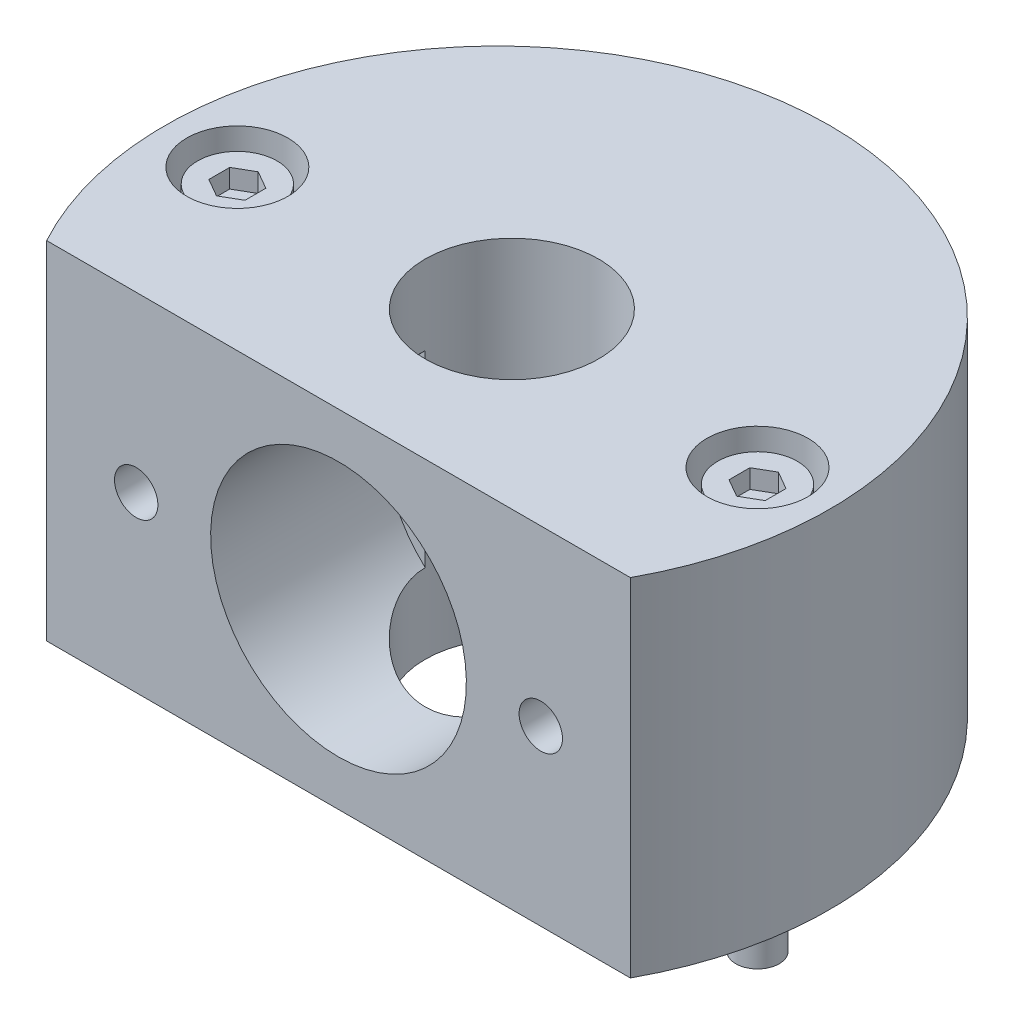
ISO-10303-21;
HEADER;
FILE_DESCRIPTION(('STEP AP214'),'2;1');
FILE_NAME('part.step','',(''),(''),'','','');
FILE_SCHEMA(('AUTOMOTIVE_DESIGN { 1 0 10303 214 1 1 1 1 }'));
ENDSEC;
DATA;
#1=APPLICATION_CONTEXT('core data for automotive mechanical design processes');
#2=APPLICATION_PROTOCOL_DEFINITION('international standard','automotive_design',2000,#1);
#3=PRODUCT_CONTEXT('',#1,'mechanical');
#4=PRODUCT('Part','Part','',(#3));
#5=PRODUCT_RELATED_PRODUCT_CATEGORY('part','',(#4));
#6=PRODUCT_DEFINITION_FORMATION('','',#4);
#7=PRODUCT_DEFINITION_CONTEXT('part definition',#1,'design');
#8=PRODUCT_DEFINITION('design','',#6,#7);
#9=PRODUCT_DEFINITION_SHAPE('','',#8);
#10=(LENGTH_UNIT() NAMED_UNIT(*) SI_UNIT(.MILLI.,.METRE.));
#11=(NAMED_UNIT(*) PLANE_ANGLE_UNIT() SI_UNIT($,.RADIAN.));
#12=(NAMED_UNIT(*) SI_UNIT($,.STERADIAN.) SOLID_ANGLE_UNIT());
#13=UNCERTAINTY_MEASURE_WITH_UNIT(LENGTH_MEASURE(1.E-05),#10,'distance_accuracy_value','');
#14=(GEOMETRIC_REPRESENTATION_CONTEXT(3) GLOBAL_UNCERTAINTY_ASSIGNED_CONTEXT((#13)) GLOBAL_UNIT_ASSIGNED_CONTEXT((#10,
#11,#12)) REPRESENTATION_CONTEXT('',''));
#15=CARTESIAN_POINT('',(0.,0.,0.));
#16=DIRECTION('',(0.,0.,1.));
#17=DIRECTION('',(1.,0.,0.));
#18=AXIS2_PLACEMENT_3D('',#15,#16,#17);
#19=CARTESIAN_POINT('',(0.,0.,0.));
#20=DIRECTION('',(0.,1.,0.));
#21=DIRECTION('',(-1.,0.,0.));
#22=AXIS2_PLACEMENT_3D('',#19,#20,#21);
#23=PLANE('',#22);
#24=CARTESIAN_POINT('',(-18.,-1.25693328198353E-13,0.));
#25=DIRECTION('',(0.,1.,0.));
#26=DIRECTION('',(-1.,0.,0.));
#27=AXIS2_PLACEMENT_3D('',#24,#25,#26);
#28=CIRCLE('',#27,1.75);
#29=CARTESIAN_POINT('',(-19.75,-1.37913512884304E-13,0.));
#30=VERTEX_POINT('',#29);
#31=EDGE_CURVE('E416',#30,#30,#28,.T.);
#32=ORIENTED_EDGE('',*,*,#31,.T.);
#33=EDGE_LOOP('',(#32));
#34=FACE_BOUND('',#33,.T.);
#35=CARTESIAN_POINT('',(0.,0.,-1.));
#36=DIRECTION('',(0.,1.,0.));
#37=DIRECTION('',(-1.,0.,0.));
#38=AXIS2_PLACEMENT_3D('',#35,#36,#37);
#39=CIRCLE('',#38,6.);
#40=CARTESIAN_POINT('',(-6.,0.,-1.));
#41=VERTEX_POINT('',#40);
#42=EDGE_CURVE('E420',#41,#41,#39,.T.);
#43=ORIENTED_EDGE('',*,*,#42,.T.);
#44=EDGE_LOOP('',(#43));
#45=FACE_BOUND('',#44,.T.);
#46=CARTESIAN_POINT('',(18.,1.25693328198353E-13,0.));
#47=DIRECTION('',(0.,1.,0.));
#48=DIRECTION('',(-1.,0.,0.));
#49=AXIS2_PLACEMENT_3D('',#46,#47,#48);
#50=CIRCLE('',#49,1.75);
#51=CARTESIAN_POINT('',(16.25,1.13473143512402E-13,0.));
#52=VERTEX_POINT('',#51);
#53=EDGE_CURVE('E423',#52,#52,#50,.T.);
#54=ORIENTED_EDGE('',*,*,#53,.T.);
#55=EDGE_LOOP('',(#54));
#56=FACE_BOUND('',#55,.T.);
#57=CARTESIAN_POINT('',(0.,0.,0.));
#58=DIRECTION('',(0.,1.,0.));
#59=DIRECTION('',(-1.,0.,0.));
#60=AXIS2_PLACEMENT_3D('',#57,#58,#59);
#61=CIRCLE('',#60,23.);
#62=CARTESIAN_POINT('',(20.1990098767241,1.79455226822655E-13,11.));
#63=VERTEX_POINT('',#62);
#64=CARTESIAN_POINT('',(-20.1990098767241,-1.02642637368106E-13,11.));
#65=VERTEX_POINT('',#64);
#66=EDGE_CURVE('E28',#63,#65,#61,.T.);
#67=ORIENTED_EDGE('',*,*,#66,.F.);
#68=DIRECTION('',(1.,0.,0.));
#69=VECTOR('',#68,1.);
#70=CARTESIAN_POINT('',(20.1990098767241,1.79455226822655E-13,11.));
#71=LINE('',#70,#69);
#72=EDGE_CURVE('E445',#65,#63,#71,.T.);
#73=ORIENTED_EDGE('',*,*,#72,.F.);
#74=EDGE_LOOP('',(#67,#73));
#75=FACE_BOUND('',#74,.T.);
#76=ADVANCED_FACE('F14',(#34,#45,#56,#75),#23,.F.);
#77=CARTESIAN_POINT('',(-15.3,12.,5.));
#78=DIRECTION('',(0.,0.,-1.));
#79=DIRECTION('',(0.,-1.,0.));
#80=AXIS2_PLACEMENT_3D('',#77,#78,#79);
#81=PLANE('',#80);
#82=CARTESIAN_POINT('',(-14.,12.,5.));
#83=DIRECTION('',(0.,0.,1.));
#84=DIRECTION('',(0.,1.,0.));
#85=AXIS2_PLACEMENT_3D('',#82,#83,#84);
#86=CIRCLE('',#85,1.5);
#87=CARTESIAN_POINT('',(-14.,13.5,4.99999999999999));
#88=VERTEX_POINT('',#87);
#89=EDGE_CURVE('E246',#88,#88,#86,.T.);
#90=ORIENTED_EDGE('',*,*,#89,.T.);
#91=EDGE_LOOP('',(#90));
#92=FACE_BOUND('',#91,.T.);
#93=ADVANCED_FACE('F292',(#92),#81,.F.);
#94=CARTESIAN_POINT('',(-14.,12.,11.));
#95=DIRECTION('',(0.,0.,1.));
#96=DIRECTION('',(0.,1.,0.));
#97=AXIS2_PLACEMENT_3D('',#94,#95,#96);
#98=CYLINDRICAL_SURFACE('',#97,1.5);
#99=ORIENTED_EDGE('',*,*,#89,.F.);
#100=EDGE_LOOP('',(#99));
#101=FACE_BOUND('',#100,.T.);
#102=CARTESIAN_POINT('',(-14.,12.,11.));
#103=DIRECTION('',(0.,0.,-1.));
#104=DIRECTION('',(0.,-1.,0.));
#105=AXIS2_PLACEMENT_3D('',#102,#103,#104);
#106=CIRCLE('',#105,1.5);
#107=CARTESIAN_POINT('',(-14.,10.5,11.));
#108=VERTEX_POINT('',#107);
#109=EDGE_CURVE('E235',#108,#108,#106,.F.);
#110=ORIENTED_EDGE('',*,*,#109,.T.);
#111=EDGE_LOOP('',(#110));
#112=FACE_BOUND('',#111,.T.);
#113=ADVANCED_FACE('F295',(#101,#112),#98,.F.);
#114=CARTESIAN_POINT('',(18.,24.,0.));
#115=DIRECTION('',(0.,1.,0.));
#116=DIRECTION('',(-1.,0.,0.));
#117=AXIS2_PLACEMENT_3D('',#114,#115,#116);
#118=CYLINDRICAL_SURFACE('',#117,1.75);
#119=CARTESIAN_POINT('',(18.,20.,0.));
#120=DIRECTION('',(0.,1.,0.));
#121=DIRECTION('',(-1.,0.,0.));
#122=AXIS2_PLACEMENT_3D('',#119,#120,#121);
#123=CIRCLE('',#122,1.75);
#124=CARTESIAN_POINT('',(16.25,20.,0.));
#125=VERTEX_POINT('',#124);
#126=EDGE_CURVE('E135',#125,#125,#123,.F.);
#127=ORIENTED_EDGE('',*,*,#126,.F.);
#128=EDGE_LOOP('',(#127));
#129=FACE_BOUND('',#128,.T.);
#130=ORIENTED_EDGE('',*,*,#53,.F.);
#131=EDGE_LOOP('',(#130));
#132=FACE_BOUND('',#131,.T.);
#133=ADVANCED_FACE('F311',(#129,#132),#118,.F.);
#134=CARTESIAN_POINT('',(14.4999999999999,20.,0.));
#135=DIRECTION('',(0.,-1.,0.));
#136=DIRECTION('',(1.,0.,0.));
#137=AXIS2_PLACEMENT_3D('',#134,#135,#136);
#138=PLANE('',#137);
#139=CARTESIAN_POINT('',(18.,20.,0.));
#140=DIRECTION('',(0.,-1.,0.));
#141=DIRECTION('',(1.,0.,0.));
#142=AXIS2_PLACEMENT_3D('',#139,#140,#141);
#143=CIRCLE('',#142,2.75);
#144=CARTESIAN_POINT('',(20.75,20.,0.));
#145=VERTEX_POINT('',#144);
#146=EDGE_CURVE('E9',#145,#145,#143,.F.);
#147=ORIENTED_EDGE('',*,*,#146,.F.);
#148=EDGE_LOOP('',(#147));
#149=FACE_BOUND('',#148,.T.);
#150=CARTESIAN_POINT('',(18.,20.,0.));
#151=DIRECTION('',(0.,1.,0.));
#152=DIRECTION('',(-1.,0.,0.));
#153=AXIS2_PLACEMENT_3D('',#150,#151,#152);
#154=CIRCLE('',#153,3.5);
#155=CARTESIAN_POINT('',(14.5,20.,0.));
#156=VERTEX_POINT('',#155);
#157=EDGE_CURVE('E236',#156,#156,#154,.T.);
#158=ORIENTED_EDGE('',*,*,#157,.T.);
#159=EDGE_LOOP('',(#158));
#160=FACE_BOUND('',#159,.T.);
#161=ADVANCED_FACE('F308',(#149,#160),#138,.F.);
#162=CARTESIAN_POINT('',(18.,24.,0.));
#163=DIRECTION('',(0.,1.,0.));
#164=DIRECTION('',(-1.,0.,0.));
#165=AXIS2_PLACEMENT_3D('',#162,#163,#164);
#166=CYLINDRICAL_SURFACE('',#165,3.5);
#167=ORIENTED_EDGE('',*,*,#157,.F.);
#168=EDGE_LOOP('',(#167));
#169=FACE_BOUND('',#168,.T.);
#170=CARTESIAN_POINT('',(18.,24.,0.));
#171=DIRECTION('',(0.,1.,0.));
#172=DIRECTION('',(-1.,0.,0.));
#173=AXIS2_PLACEMENT_3D('',#170,#171,#172);
#174=CIRCLE('',#173,3.5);
#175=CARTESIAN_POINT('',(14.5,24.,0.));
#176=VERTEX_POINT('',#175);
#177=EDGE_CURVE('E425',#176,#176,#174,.T.);
#178=ORIENTED_EDGE('',*,*,#177,.T.);
#179=EDGE_LOOP('',(#178));
#180=FACE_BOUND('',#179,.T.);
#181=ADVANCED_FACE('F301',(#169,#180),#166,.F.);
#182=CARTESIAN_POINT('',(12.7,12.,5.));
#183=DIRECTION('',(0.,0.,-1.));
#184=DIRECTION('',(0.,-1.,0.));
#185=AXIS2_PLACEMENT_3D('',#182,#183,#184);
#186=PLANE('',#185);
#187=CARTESIAN_POINT('',(14.,12.0000000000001,5.));
#188=DIRECTION('',(0.,0.,1.));
#189=DIRECTION('',(0.,1.,0.));
#190=AXIS2_PLACEMENT_3D('',#187,#188,#189);
#191=CIRCLE('',#190,1.5);
#192=CARTESIAN_POINT('',(14.,13.5000000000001,4.99999999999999));
#193=VERTEX_POINT('',#192);
#194=EDGE_CURVE('E243',#193,#193,#191,.T.);
#195=ORIENTED_EDGE('',*,*,#194,.T.);
#196=EDGE_LOOP('',(#195));
#197=FACE_BOUND('',#196,.T.);
#198=ADVANCED_FACE('F297',(#197),#186,.F.);
#199=CARTESIAN_POINT('',(14.,12.0000000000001,11.));
#200=DIRECTION('',(0.,0.,1.));
#201=DIRECTION('',(0.,1.,0.));
#202=AXIS2_PLACEMENT_3D('',#199,#200,#201);
#203=CYLINDRICAL_SURFACE('',#202,1.5);
#204=ORIENTED_EDGE('',*,*,#194,.F.);
#205=EDGE_LOOP('',(#204));
#206=FACE_BOUND('',#205,.T.);
#207=CARTESIAN_POINT('',(14.,12.0000000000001,11.));
#208=DIRECTION('',(0.,0.,-1.));
#209=DIRECTION('',(0.,-1.,0.));
#210=AXIS2_PLACEMENT_3D('',#207,#208,#209);
#211=CIRCLE('',#210,1.5);
#212=CARTESIAN_POINT('',(14.,10.5000000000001,11.));
#213=VERTEX_POINT('',#212);
#214=EDGE_CURVE('E240',#213,#213,#211,.F.);
#215=ORIENTED_EDGE('',*,*,#214,.T.);
#216=EDGE_LOOP('',(#215));
#217=FACE_BOUND('',#216,.T.);
#218=ADVANCED_FACE('F300',(#206,#217),#203,.F.);
#219=CARTESIAN_POINT('',(-1.6759110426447E-13,24.,0.));
#220=DIRECTION('',(0.,1.,0.));
#221=DIRECTION('',(-1.,0.,0.));
#222=AXIS2_PLACEMENT_3D('',#219,#220,#221);
#223=PLANE('',#222);
#224=ORIENTED_EDGE('',*,*,#177,.F.);
#225=EDGE_LOOP('',(#224));
#226=FACE_BOUND('',#225,.T.);
#227=CARTESIAN_POINT('',(-1.6759110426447E-13,24.,0.));
#228=DIRECTION('',(0.,1.,0.));
#229=DIRECTION('',(-1.,0.,0.));
#230=AXIS2_PLACEMENT_3D('',#227,#228,#229);
#231=CIRCLE('',#230,23.);
#232=CARTESIAN_POINT('',(-20.1990098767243,24.,11.));
#233=VERTEX_POINT('',#232);
#234=CARTESIAN_POINT('',(20.199009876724,24.,11.));
#235=VERTEX_POINT('',#234);
#236=EDGE_CURVE('E438',#233,#235,#231,.F.);
#237=ORIENTED_EDGE('',*,*,#236,.F.);
#238=DIRECTION('',(-1.,0.,0.));
#239=VECTOR('',#238,1.);
#240=CARTESIAN_POINT('',(-1.6759110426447E-13,24.,11.));
#241=LINE('',#240,#239);
#242=EDGE_CURVE('E435',#235,#233,#241,.T.);
#243=ORIENTED_EDGE('',*,*,#242,.F.);
#244=EDGE_LOOP('',(#237,#243));
#245=FACE_BOUND('',#244,.T.);
#246=CARTESIAN_POINT('',(-1.6759110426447E-13,24.,-1.00000000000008));
#247=DIRECTION('',(0.,1.,0.));
#248=DIRECTION('',(-1.,0.,0.));
#249=AXIS2_PLACEMENT_3D('',#246,#247,#248);
#250=CIRCLE('',#249,6.);
#251=CARTESIAN_POINT('',(-6.00000000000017,24.,-1.00000000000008));
#252=VERTEX_POINT('',#251);
#253=EDGE_CURVE('E491',#252,#252,#250,.T.);
#254=ORIENTED_EDGE('',*,*,#253,.F.);
#255=EDGE_LOOP('',(#254));
#256=FACE_BOUND('',#255,.T.);
#257=CARTESIAN_POINT('',(-18.,24.,0.));
#258=DIRECTION('',(0.,1.,0.));
#259=DIRECTION('',(-1.,0.,0.));
#260=AXIS2_PLACEMENT_3D('',#257,#258,#259);
#261=CIRCLE('',#260,3.5);
#262=CARTESIAN_POINT('',(-21.5,24.,0.));
#263=VERTEX_POINT('',#262);
#264=EDGE_CURVE('E441',#263,#263,#261,.T.);
#265=ORIENTED_EDGE('',*,*,#264,.F.);
#266=EDGE_LOOP('',(#265));
#267=FACE_BOUND('',#266,.T.);
#268=ADVANCED_FACE('F458',(#226,#245,#256,#267),#223,.T.);
#269=CARTESIAN_POINT('',(-1.6759110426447E-13,24.,0.));
#270=DIRECTION('',(0.,-1.,0.));
#271=DIRECTION('',(1.,0.,0.));
#272=AXIS2_PLACEMENT_3D('',#269,#270,#271);
#273=CYLINDRICAL_SURFACE('',#272,23.);
#274=DIRECTION('',(0.,-1.,0.));
#275=VECTOR('',#274,1.);
#276=CARTESIAN_POINT('',(20.199009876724,24.,11.));
#277=LINE('',#276,#275);
#278=EDGE_CURVE('E253',#235,#63,#277,.T.);
#279=ORIENTED_EDGE('',*,*,#278,.T.);
#280=ORIENTED_EDGE('',*,*,#66,.T.);
#281=DIRECTION('',(0.,-1.,0.));
#282=VECTOR('',#281,1.);
#283=CARTESIAN_POINT('',(-20.1990098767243,24.,11.));
#284=LINE('',#283,#282);
#285=EDGE_CURVE('E255',#233,#65,#284,.T.);
#286=ORIENTED_EDGE('',*,*,#285,.F.);
#287=ORIENTED_EDGE('',*,*,#236,.T.);
#288=EDGE_LOOP('',(#279,#280,#286,#287));
#289=FACE_BOUND('',#288,.T.);
#290=ADVANCED_FACE('F460',(#289),#273,.T.);
#291=CARTESIAN_POINT('',(20.199009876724,24.,11.));
#292=DIRECTION('',(0.,0.,-1.));
#293=DIRECTION('',(0.,-1.,0.));
#294=AXIS2_PLACEMENT_3D('',#291,#292,#293);
#295=PLANE('',#294);
#296=ORIENTED_EDGE('',*,*,#109,.F.);
#297=EDGE_LOOP('',(#296));
#298=FACE_BOUND('',#297,.T.);
#299=ORIENTED_EDGE('',*,*,#214,.F.);
#300=EDGE_LOOP('',(#299));
#301=FACE_BOUND('',#300,.T.);
#302=CARTESIAN_POINT('',(0.,12.,11.));
#303=DIRECTION('',(0.,0.,-1.));
#304=DIRECTION('',(0.,-1.,0.));
#305=AXIS2_PLACEMENT_3D('',#302,#303,#304);
#306=CIRCLE('',#305,8.85);
#307=CARTESIAN_POINT('',(0.,3.15,11.));
#308=VERTEX_POINT('',#307);
#309=EDGE_CURVE('E439',#308,#308,#306,.F.);
#310=ORIENTED_EDGE('',*,*,#309,.F.);
#311=EDGE_LOOP('',(#310));
#312=FACE_BOUND('',#311,.T.);
#313=ORIENTED_EDGE('',*,*,#285,.T.);
#314=ORIENTED_EDGE('',*,*,#72,.T.);
#315=ORIENTED_EDGE('',*,*,#278,.F.);
#316=ORIENTED_EDGE('',*,*,#242,.T.);
#317=EDGE_LOOP('',(#313,#314,#315,#316));
#318=FACE_BOUND('',#317,.T.);
#319=ADVANCED_FACE('F290',(#298,#301,#312,#318),#295,.F.);
#320=CARTESIAN_POINT('',(0.,12.,-1.00000000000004));
#321=DIRECTION('',(0.,0.,1.));
#322=DIRECTION('',(0.,1.,0.));
#323=AXIS2_PLACEMENT_3D('',#320,#321,#322);
#324=PLANE('',#323);
#325=CARTESIAN_POINT('',(0.,12.,-1.00000000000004));
#326=DIRECTION('',(0.,0.,1.));
#327=DIRECTION('',(0.,1.,0.));
#328=AXIS2_PLACEMENT_3D('',#325,#326,#327);
#329=CIRCLE('',#328,8.85);
#330=CARTESIAN_POINT('',(6.,5.49442546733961,-1.00000000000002));
#331=VERTEX_POINT('',#330);
#332=CARTESIAN_POINT('',(5.99999999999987,18.5055745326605,-1.00000000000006));
#333=VERTEX_POINT('',#332);
#334=EDGE_CURVE('E249',#331,#333,#329,.T.);
#335=ORIENTED_EDGE('',*,*,#334,.T.);
#336=DIRECTION('',(0.,-1.,0.));
#337=VECTOR('',#336,1.);
#338=CARTESIAN_POINT('',(5.99999999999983,24.,-1.00000000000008));
#339=LINE('',#338,#337);
#340=EDGE_CURVE('E258',#331,#333,#339,.F.);
#341=ORIENTED_EDGE('',*,*,#340,.F.);
#342=EDGE_LOOP('',(#335,#341));
#343=FACE_BOUND('',#342,.T.);
#344=ADVANCED_FACE('F285',(#343),#324,.T.);
#345=CARTESIAN_POINT('',(-6.00000000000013,18.5055745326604,-1.00000000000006));
#346=VERTEX_POINT('',#345);
#347=CARTESIAN_POINT('',(-6.,5.49442546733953,-1.00000000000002));
#348=VERTEX_POINT('',#347);
#349=EDGE_CURVE('E250',#346,#348,#329,.T.);
#350=ORIENTED_EDGE('',*,*,#349,.T.);
#351=DIRECTION('',(0.,-1.,0.));
#352=VECTOR('',#351,1.);
#353=CARTESIAN_POINT('',(-6.00000000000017,24.,-1.00000000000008));
#354=LINE('',#353,#352);
#355=EDGE_CURVE('E494',#346,#348,#354,.T.);
#356=ORIENTED_EDGE('',*,*,#355,.F.);
#357=EDGE_LOOP('',(#350,#356));
#358=FACE_BOUND('',#357,.T.);
#359=ADVANCED_FACE('F289',(#358),#324,.T.);
#360=CARTESIAN_POINT('',(-1.6759110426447E-13,24.,-1.00000000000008));
#361=DIRECTION('',(0.,-1.,0.));
#362=DIRECTION('',(1.,0.,0.));
#363=AXIS2_PLACEMENT_3D('',#360,#361,#362);
#364=CYLINDRICAL_SURFACE('',#363,6.);
#365=ORIENTED_EDGE('',*,*,#42,.F.);
#366=EDGE_LOOP('',(#365));
#367=FACE_BOUND('',#366,.T.);
#368=ORIENTED_EDGE('',*,*,#253,.T.);
#369=EDGE_LOOP('',(#368));
#370=FACE_BOUND('',#369,.T.);
#371=CARTESIAN_POINT('',(5.99999999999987,18.5055745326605,-1.00000000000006));
#372=CARTESIAN_POINT('',(6.00004016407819,18.5054890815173,-0.85328037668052));
#373=CARTESIAN_POINT('',(5.99462041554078,18.5105355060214,-0.70661127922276));
#374=CARTESIAN_POINT('',(5.973180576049,18.5302366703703,-0.414901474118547));
#375=CARTESIAN_POINT('',(5.95717551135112,18.5448777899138,-0.269858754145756));
#376=CARTESIAN_POINT('',(5.91509921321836,18.5829207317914,0.0160243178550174));
#377=CARTESIAN_POINT('',(5.88913262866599,18.6062314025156,0.15689248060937));
#378=CARTESIAN_POINT('',(5.82760701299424,18.6605697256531,0.435020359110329));
#379=CARTESIAN_POINT('',(5.79204500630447,18.6915997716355,0.572278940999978));
#380=CARTESIAN_POINT('',(5.71207905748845,18.7599848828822,0.84168211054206));
#381=CARTESIAN_POINT('',(5.66772518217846,18.7973039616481,0.973850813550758));
#382=CARTESIAN_POINT('',(5.57056918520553,18.8771517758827,1.23337389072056));
#383=CARTESIAN_POINT('',(5.51776753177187,18.9196802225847,1.36072853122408));
#384=CARTESIAN_POINT('',(5.34706244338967,19.0535330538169,1.73578770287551));
#385=CARTESIAN_POINT('',(5.21704283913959,19.150960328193,1.97587819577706));
#386=CARTESIAN_POINT('',(4.90428382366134,19.3696984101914,2.47087746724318));
#387=CARTESIAN_POINT('',(4.71642999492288,19.4923312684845,2.72196713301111));
#388=CARTESIAN_POINT('',(4.4071236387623,19.6755600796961,3.07451920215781));
#389=CARTESIAN_POINT('',(4.29936808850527,19.7365491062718,3.18807778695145));
#390=CARTESIAN_POINT('',(4.07484546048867,19.8571210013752,3.40683625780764));
#391=CARTESIAN_POINT('',(3.9580763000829,19.9167035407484,3.51203420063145));
#392=CARTESIAN_POINT('',(3.69734442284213,20.0421484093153,3.72891337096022));
#393=CARTESIAN_POINT('',(3.55195202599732,20.1075803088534,3.83913155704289));
#394=CARTESIAN_POINT('',(3.25022557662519,20.2331779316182,4.04673612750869));
#395=CARTESIAN_POINT('',(3.09389642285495,20.2933459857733,4.1441282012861));
#396=CARTESIAN_POINT('',(2.77116689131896,20.4066849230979,4.32492296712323));
#397=CARTESIAN_POINT('',(2.60477780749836,20.4598634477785,4.40834096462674));
#398=CARTESIAN_POINT('',(2.26286729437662,20.5576578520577,4.56006963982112));
#399=CARTESIAN_POINT('',(2.08734954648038,20.602277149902,4.6283863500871));
#400=CARTESIAN_POINT('',(1.77448478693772,20.671356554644,4.73332832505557));
#401=CARTESIAN_POINT('',(1.63883961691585,20.6980547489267,4.77359123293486));
#402=CARTESIAN_POINT('',(1.36405433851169,20.7453574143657,4.84461120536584));
#403=CARTESIAN_POINT('',(1.22491498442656,20.7659631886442,4.87537030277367));
#404=CARTESIAN_POINT('',(0.944091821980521,20.8006360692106,4.92697732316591));
#405=CARTESIAN_POINT('',(0.802409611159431,20.8147071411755,4.94783125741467));
#406=CARTESIAN_POINT('',(0.517398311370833,20.8360182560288,4.97936904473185));
#407=CARTESIAN_POINT('',(0.374069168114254,20.8432580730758,4.99005256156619));
#408=CARTESIAN_POINT('',(0.0865870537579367,20.8507464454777,5.00110234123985));
#409=CARTESIAN_POINT('',(-0.0575669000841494,20.8509831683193,5.00145114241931));
#410=CARTESIAN_POINT('',(-0.345364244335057,20.8444299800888,4.99178222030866));
#411=CARTESIAN_POINT('',(-0.489007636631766,20.837640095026,4.98176453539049));
#412=CARTESIAN_POINT('',(-0.774723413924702,20.8171888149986,4.95150759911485));
#413=CARTESIAN_POINT('',(-0.916795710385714,20.8035270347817,4.9312677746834));
#414=CARTESIAN_POINT('',(-1.19841556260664,20.7696309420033,4.88083962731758));
#415=CARTESIAN_POINT('',(-1.337962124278,20.7493940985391,4.85064747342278));
#416=CARTESIAN_POINT('',(-1.61101812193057,20.7032137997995,4.78135676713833));
#417=CARTESIAN_POINT('',(-1.74459159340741,20.6773836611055,4.74243458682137));
#418=CARTESIAN_POINT('',(-2.00769775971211,20.6203134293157,4.6558251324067));
#419=CARTESIAN_POINT('',(-2.13722901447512,20.5890714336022,4.60813477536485));
#420=CARTESIAN_POINT('',(-2.51872934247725,20.4880821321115,4.45264179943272));
#421=CARTESIAN_POINT('',(-2.76381341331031,20.4110349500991,4.33236350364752));
#422=CARTESIAN_POINT('',(-3.25804867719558,20.2331230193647,4.04733493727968));
#423=CARTESIAN_POINT('',(-3.50454447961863,20.1305525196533,3.87910006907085));
#424=CARTESIAN_POINT('',(-3.96761628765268,19.914908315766,3.51061843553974));
#425=CARTESIAN_POINT('',(-4.18415647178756,19.8018223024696,3.31033395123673));
#426=CARTESIAN_POINT('',(-4.5016629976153,19.6207465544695,2.97045091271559));
#427=CARTESIAN_POINT('',(-4.61327842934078,19.5535336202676,2.84019527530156));
#428=CARTESIAN_POINT('',(-4.82519597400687,19.4199496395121,2.57028385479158));
#429=CARTESIAN_POINT('',(-4.92549572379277,19.3535787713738,2.4306261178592));
#430=CARTESIAN_POINT('',(-5.11421312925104,19.2236036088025,2.14236758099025));
#431=CARTESIAN_POINT('',(-5.20263648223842,19.1599979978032,1.99377111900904));
#432=CARTESIAN_POINT('',(-5.36703321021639,19.037610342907,1.68796124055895));
#433=CARTESIAN_POINT('',(-5.44300470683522,18.9788290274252,1.53074652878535));
#434=CARTESIAN_POINT('',(-5.61708379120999,18.8402335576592,1.12568346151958));
#435=CARTESIAN_POINT('',(-5.7067626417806,18.7649521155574,0.872450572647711));
#436=CARTESIAN_POINT('',(-5.81577371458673,18.6709500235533,0.481573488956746));
#437=CARTESIAN_POINT('',(-5.8478372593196,18.6427908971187,0.349601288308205));
#438=CARTESIAN_POINT('',(-5.90311390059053,18.593717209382,0.0825062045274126));
#439=CARTESIAN_POINT('',(-5.9263309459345,18.5727994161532,-0.0526152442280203));
#440=CARTESIAN_POINT('',(-5.96314368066,18.5394235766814,-0.322453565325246));
#441=CARTESIAN_POINT('',(-5.97691971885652,18.5268071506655,-0.457126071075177));
#442=CARTESIAN_POINT('',(-5.99537070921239,18.5098435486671,-0.727851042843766));
#443=CARTESIAN_POINT('',(-6.00002911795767,18.5055114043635,-0.863905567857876));
#444=CARTESIAN_POINT('',(-6.00000000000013,18.5055745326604,-1.00000000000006));
#445=B_SPLINE_CURVE_WITH_KNOTS('',3,(#371,#372,#373,#374,#375,#376,#377,#378,#379,#380,#381,
#382,#383,#384,#385,#386,#387,#388,#389,#390,#391,#392,#393,#394,#395,#396,#397,#398,#399,#400,
#401,#402,#403,#404,#405,#406,#407,#408,#409,#410,#411,#412,#413,#414,#415,#416,#417,#418,#419,
#420,#421,#422,#423,#424,#425,#426,#427,#428,#429,#430,#431,#432,#433,#434,#435,#436,#437,#438,
#439,#440,#441,#442,#443,#444),.UNSPECIFIED.,.F.,.F.,(4,2,2,2,2,2,2,2,2,2,2,2,2,2,2,2,2,2,2,2,2,
2,2,2,2,2,2,2,2,2,2,2,2,2,2,2,4),(0.,0.439891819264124,0.879160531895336,1.31393565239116,
1.74884575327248,2.18134687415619,2.61382403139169,3.48073117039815,4.48695302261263,
4.99060979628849,5.4943832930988,6.07508512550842,6.65552849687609,7.23533190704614,
7.81490328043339,8.2464321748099,8.67786870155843,9.10904306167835,9.54023167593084,
9.97214879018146,10.4040643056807,10.8360040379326,11.2681102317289,11.692167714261,
12.1163745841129,12.9641402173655,13.9074634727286,14.8519051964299,15.4041032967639,
15.9564165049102,16.5084638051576,17.0605943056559,17.8938915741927,18.3095849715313,
18.7250925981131,19.132423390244,19.5404925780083),.UNSPECIFIED.);
#446=EDGE_CURVE('E270',#333,#346,#445,.T.);
#447=ORIENTED_EDGE('',*,*,#446,.T.);
#448=ORIENTED_EDGE('',*,*,#355,.T.);
#449=CARTESIAN_POINT('',(-6.,5.49442546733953,-1.00000000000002));
#450=CARTESIAN_POINT('',(-6.00004016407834,5.49451091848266,-0.853280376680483));
#451=CARTESIAN_POINT('',(-5.99462041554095,5.4894644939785,-0.706611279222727));
#452=CARTESIAN_POINT('',(-5.97318057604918,5.46976332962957,-0.414901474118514));
#453=CARTESIAN_POINT('',(-5.95717551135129,5.45512221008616,-0.269858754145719));
#454=CARTESIAN_POINT('',(-5.91509921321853,5.41707926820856,0.0160243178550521));
#455=CARTESIAN_POINT('',(-5.88913262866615,5.39376859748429,0.1568924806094));
#456=CARTESIAN_POINT('',(-5.82760701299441,5.33943027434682,0.435020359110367));
#457=CARTESIAN_POINT('',(-5.79204500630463,5.3084002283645,0.572278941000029));
#458=CARTESIAN_POINT('',(-5.71207905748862,5.24001511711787,0.841682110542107));
#459=CARTESIAN_POINT('',(-5.66772518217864,5.2026960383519,0.973850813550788));
#460=CARTESIAN_POINT('',(-5.57056918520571,5.12284822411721,1.23337389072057));
#461=CARTESIAN_POINT('',(-5.51776753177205,5.08031977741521,1.3607285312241));
#462=CARTESIAN_POINT('',(-5.34706244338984,4.94646694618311,1.73578770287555));
#463=CARTESIAN_POINT('',(-5.21704283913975,4.84903967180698,1.97587819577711));
#464=CARTESIAN_POINT('',(-4.9042838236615,4.63030158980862,2.47087746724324));
#465=CARTESIAN_POINT('',(-4.71642999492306,4.50766873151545,2.72196713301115));
#466=CARTESIAN_POINT('',(-4.4071236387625,4.32443992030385,3.07451920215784));
#467=CARTESIAN_POINT('',(-4.29936808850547,4.26345089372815,3.18807778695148));
#468=CARTESIAN_POINT('',(-4.07484546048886,4.14287899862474,3.40683625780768));
#469=CARTESIAN_POINT('',(-3.95807630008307,4.08329645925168,3.5120342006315));
#470=CARTESIAN_POINT('',(-3.6973444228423,3.95785159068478,3.72891337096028));
#471=CARTESIAN_POINT('',(-3.55195202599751,3.89241969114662,3.83913155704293));
#472=CARTESIAN_POINT('',(-3.25022557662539,3.7668220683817,4.04673612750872));
#473=CARTESIAN_POINT('',(-3.09389642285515,3.70665401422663,4.14412820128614));
#474=CARTESIAN_POINT('',(-2.77116689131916,3.59331507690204,4.32492296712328));
#475=CARTESIAN_POINT('',(-2.60477780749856,3.54013655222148,4.40834096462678));
#476=CARTESIAN_POINT('',(-2.26286729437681,3.44234214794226,4.56006963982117));
#477=CARTESIAN_POINT('',(-2.08734954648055,3.39772285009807,4.62838635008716));
#478=CARTESIAN_POINT('',(-1.77448478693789,3.32864344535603,4.73332832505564));
#479=CARTESIAN_POINT('',(-1.63883961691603,3.30194525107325,4.77359123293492));
#480=CARTESIAN_POINT('',(-1.36405433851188,3.25464258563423,4.8446112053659));
#481=CARTESIAN_POINT('',(-1.22491498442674,3.23403681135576,4.87537030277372));
#482=CARTESIAN_POINT('',(-0.944091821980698,3.19936393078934,4.92697732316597));
#483=CARTESIAN_POINT('',(-0.802409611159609,3.18529285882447,4.94783125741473));
#484=CARTESIAN_POINT('',(-0.517398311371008,3.16398174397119,4.97936904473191));
#485=CARTESIAN_POINT('',(-0.374069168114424,3.15674192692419,4.99005256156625));
#486=CARTESIAN_POINT('',(-0.0865870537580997,3.14925355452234,5.00110234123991));
#487=CARTESIAN_POINT('',(0.057566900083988,3.14901683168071,5.00145114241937));
#488=CARTESIAN_POINT('',(0.345364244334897,3.15557001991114,4.99178222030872));
#489=CARTESIAN_POINT('',(0.489007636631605,3.16235990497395,4.98176453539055));
#490=CARTESIAN_POINT('',(0.774723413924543,3.18281118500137,4.95150759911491));
#491=CARTESIAN_POINT('',(0.916795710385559,3.19647296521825,4.93126777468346));
#492=CARTESIAN_POINT('',(1.19841556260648,3.23036905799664,4.88083962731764));
#493=CARTESIAN_POINT('',(1.33796212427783,3.25060590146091,4.85064747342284));
#494=CARTESIAN_POINT('',(1.61101812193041,3.29678620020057,4.78135676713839));
#495=CARTESIAN_POINT('',(1.74459159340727,3.32261633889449,4.74243458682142));
#496=CARTESIAN_POINT('',(2.00769775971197,3.37968657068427,4.65582513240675));
#497=CARTESIAN_POINT('',(2.13722901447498,3.41092856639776,4.6081347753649));
#498=CARTESIAN_POINT('',(2.5187293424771,3.51191786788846,4.45264179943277));
#499=CARTESIAN_POINT('',(2.76381341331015,3.58896504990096,4.33236350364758));
#500=CARTESIAN_POINT('',(3.25804867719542,3.76687698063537,4.04733493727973));
#501=CARTESIAN_POINT('',(3.50454447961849,3.86944748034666,3.87910006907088));
#502=CARTESIAN_POINT('',(3.96761628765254,4.08509168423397,3.51061843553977));
#503=CARTESIAN_POINT('',(4.18415647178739,4.19817769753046,3.31033395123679));
#504=CARTESIAN_POINT('',(4.50166299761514,4.37925344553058,2.97045091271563));
#505=CARTESIAN_POINT('',(4.61327842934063,4.44646637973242,2.84019527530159));
#506=CARTESIAN_POINT('',(4.82519597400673,4.58005036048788,2.5702838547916));
#507=CARTESIAN_POINT('',(4.92549572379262,4.64642122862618,2.43062611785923));
#508=CARTESIAN_POINT('',(5.11421312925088,4.77639639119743,2.14236758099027));
#509=CARTESIAN_POINT('',(5.20263648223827,4.84000200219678,1.99377111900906));
#510=CARTESIAN_POINT('',(5.36703321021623,4.96238965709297,1.68796124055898));
#511=CARTESIAN_POINT('',(5.44300470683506,5.02117097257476,1.53074652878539));
#512=CARTESIAN_POINT('',(5.61708379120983,5.15976644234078,1.12568346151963));
#513=CARTESIAN_POINT('',(5.70676264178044,5.23504788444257,0.872450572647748));
#514=CARTESIAN_POINT('',(5.81577371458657,5.32904997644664,0.481573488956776));
#515=CARTESIAN_POINT('',(5.84783725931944,5.35720910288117,0.349601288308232));
#516=CARTESIAN_POINT('',(5.90311390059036,5.40628279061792,0.0825062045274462));
#517=CARTESIAN_POINT('',(5.92633094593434,5.42720058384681,-0.0526152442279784));
#518=CARTESIAN_POINT('',(5.96314368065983,5.46057642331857,-0.3224535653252));
#519=CARTESIAN_POINT('',(5.97691971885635,5.47319284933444,-0.457126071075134));
#520=CARTESIAN_POINT('',(5.99537070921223,5.49015645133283,-0.727851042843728));
#521=CARTESIAN_POINT('',(6.00002911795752,5.49448859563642,-0.86390556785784));
#522=CARTESIAN_POINT('',(6.,5.49442546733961,-1.00000000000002));
#523=B_SPLINE_CURVE_WITH_KNOTS('',3,(#449,#450,#451,#452,#453,#454,#455,#456,#457,#458,#459,
#460,#461,#462,#463,#464,#465,#466,#467,#468,#469,#470,#471,#472,#473,#474,#475,#476,#477,#478,
#479,#480,#481,#482,#483,#484,#485,#486,#487,#488,#489,#490,#491,#492,#493,#494,#495,#496,#497,
#498,#499,#500,#501,#502,#503,#504,#505,#506,#507,#508,#509,#510,#511,#512,#513,#514,#515,#516,
#517,#518,#519,#520,#521,#522),.UNSPECIFIED.,.F.,.F.,(4,2,2,2,2,2,2,2,2,2,2,2,2,2,2,2,2,2,2,2,2,
2,2,2,2,2,2,2,2,2,2,2,2,2,2,2,4),(0.,0.439891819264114,0.879160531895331,1.31393565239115,
1.74884575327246,2.18134687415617,2.61382403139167,3.48073117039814,4.48695302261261,
4.99060979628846,5.49438329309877,6.07508512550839,6.65552849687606,7.23533190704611,
7.81490328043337,8.24643217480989,8.67786870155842,9.10904306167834,9.54023167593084,
9.97214879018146,10.4040643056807,10.8360040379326,11.2681102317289,11.692167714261,
12.116374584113,12.9641402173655,13.9074634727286,14.85190519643,15.4041032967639,
15.9564165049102,16.5084638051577,17.0605943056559,17.8938915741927,18.3095849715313,
18.7250925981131,19.132423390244,19.5404925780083),.UNSPECIFIED.);
#524=EDGE_CURVE('E261',#348,#331,#523,.T.);
#525=ORIENTED_EDGE('',*,*,#524,.T.);
#526=ORIENTED_EDGE('',*,*,#340,.T.);
#527=EDGE_LOOP('',(#447,#448,#525,#526));
#528=FACE_BOUND('',#527,.T.);
#529=ADVANCED_FACE('F276',(#367,#370,#528),#364,.F.);
#530=CARTESIAN_POINT('',(0.,12.,11.));
#531=DIRECTION('',(0.,0.,-1.));
#532=DIRECTION('',(0.,-1.,0.));
#533=AXIS2_PLACEMENT_3D('',#530,#531,#532);
#534=CYLINDRICAL_SURFACE('',#533,8.85);
#535=ORIENTED_EDGE('',*,*,#309,.T.);
#536=EDGE_LOOP('',(#535));
#537=FACE_BOUND('',#536,.T.);
#538=ORIENTED_EDGE('',*,*,#334,.F.);
#539=ORIENTED_EDGE('',*,*,#524,.F.);
#540=ORIENTED_EDGE('',*,*,#349,.F.);
#541=ORIENTED_EDGE('',*,*,#446,.F.);
#542=EDGE_LOOP('',(#538,#539,#540,#541));
#543=FACE_BOUND('',#542,.T.);
#544=ADVANCED_FACE('F279',(#537,#543),#534,.F.);
#545=CARTESIAN_POINT('',(-18.,24.,0.));
#546=DIRECTION('',(0.,1.,0.));
#547=DIRECTION('',(-1.,0.,0.));
#548=AXIS2_PLACEMENT_3D('',#545,#546,#547);
#549=CYLINDRICAL_SURFACE('',#548,3.5);
#550=CARTESIAN_POINT('',(-18.,20.,0.));
#551=DIRECTION('',(0.,1.,0.));
#552=DIRECTION('',(-1.,0.,0.));
#553=AXIS2_PLACEMENT_3D('',#550,#551,#552);
#554=CIRCLE('',#553,3.5);
#555=CARTESIAN_POINT('',(-21.5,20.,0.));
#556=VERTEX_POINT('',#555);
#557=EDGE_CURVE('E239',#556,#556,#554,.T.);
#558=ORIENTED_EDGE('',*,*,#557,.F.);
#559=EDGE_LOOP('',(#558));
#560=FACE_BOUND('',#559,.T.);
#561=ORIENTED_EDGE('',*,*,#264,.T.);
#562=EDGE_LOOP('',(#561));
#563=FACE_BOUND('',#562,.T.);
#564=ADVANCED_FACE('F283',(#560,#563),#549,.F.);
#565=CARTESIAN_POINT('',(-21.5,20.,0.));
#566=DIRECTION('',(0.,-1.,0.));
#567=DIRECTION('',(1.,0.,0.));
#568=AXIS2_PLACEMENT_3D('',#565,#566,#567);
#569=PLANE('',#568);
#570=CARTESIAN_POINT('',(-18.,20.,0.));
#571=DIRECTION('',(0.,-1.,0.));
#572=DIRECTION('',(1.,0.,0.));
#573=AXIS2_PLACEMENT_3D('',#570,#571,#572);
#574=CIRCLE('',#573,2.75);
#575=CARTESIAN_POINT('',(-15.25,20.,0.));
#576=VERTEX_POINT('',#575);
#577=EDGE_CURVE('E21',#576,#576,#574,.F.);
#578=ORIENTED_EDGE('',*,*,#577,.F.);
#579=EDGE_LOOP('',(#578));
#580=FACE_BOUND('',#579,.T.);
#581=ORIENTED_EDGE('',*,*,#557,.T.);
#582=EDGE_LOOP('',(#581));
#583=FACE_BOUND('',#582,.T.);
#584=ADVANCED_FACE('F303',(#580,#583),#569,.F.);
#585=CARTESIAN_POINT('',(-18.,24.,0.));
#586=DIRECTION('',(0.,1.,0.));
#587=DIRECTION('',(-1.,0.,0.));
#588=AXIS2_PLACEMENT_3D('',#585,#586,#587);
#589=CYLINDRICAL_SURFACE('',#588,1.75);
#590=CARTESIAN_POINT('',(-18.,20.,0.));
#591=DIRECTION('',(0.,1.,0.));
#592=DIRECTION('',(-1.,0.,0.));
#593=AXIS2_PLACEMENT_3D('',#590,#591,#592);
#594=CIRCLE('',#593,1.75);
#595=CARTESIAN_POINT('',(-19.75,20.,0.));
#596=VERTEX_POINT('',#595);
#597=EDGE_CURVE('E232',#596,#596,#594,.F.);
#598=ORIENTED_EDGE('',*,*,#597,.F.);
#599=EDGE_LOOP('',(#598));
#600=FACE_BOUND('',#599,.T.);
#601=ORIENTED_EDGE('',*,*,#31,.F.);
#602=EDGE_LOOP('',(#601));
#603=FACE_BOUND('',#602,.T.);
#604=ADVANCED_FACE('F306',(#600,#603),#589,.F.);
#605=CARTESIAN_POINT('',(-18.,-5.00000000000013,0.));
#606=DIRECTION('',(0.,1.,0.));
#607=DIRECTION('',(1.,0.,0.));
#608=AXIS2_PLACEMENT_3D('',#605,#606,#607);
#609=PLANE('',#608);
#610=CARTESIAN_POINT('',(-18.,-5.00000000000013,0.));
#611=DIRECTION('',(0.,1.,0.));
#612=DIRECTION('',(1.,0.,0.));
#613=AXIS2_PLACEMENT_3D('',#610,#611,#612);
#614=CIRCLE('',#613,1.5);
#615=CARTESIAN_POINT('',(-16.5,-5.00000000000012,0.));
#616=VERTEX_POINT('',#615);
#617=EDGE_CURVE('E224',#616,#616,#614,.T.);
#618=ORIENTED_EDGE('',*,*,#617,.F.);
#619=EDGE_LOOP('',(#618));
#620=FACE_BOUND('',#619,.T.);
#621=ADVANCED_FACE('F329',(#620),#609,.F.);
#622=CARTESIAN_POINT('',(-18.,-5.00000000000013,0.));
#623=DIRECTION('',(0.,1.,0.));
#624=DIRECTION('',(1.,0.,0.));
#625=AXIS2_PLACEMENT_3D('',#622,#623,#624);
#626=CYLINDRICAL_SURFACE('',#625,1.5);
#627=ORIENTED_EDGE('',*,*,#617,.T.);
#628=EDGE_LOOP('',(#627));
#629=FACE_BOUND('',#628,.T.);
#630=CARTESIAN_POINT('',(-18.,20.,0.));
#631=DIRECTION('',(0.,1.,0.));
#632=DIRECTION('',(1.,0.,0.));
#633=AXIS2_PLACEMENT_3D('',#630,#631,#632);
#634=CIRCLE('',#633,1.5);
#635=CARTESIAN_POINT('',(-16.5,20.,0.));
#636=VERTEX_POINT('',#635);
#637=EDGE_CURVE('E213',#636,#636,#634,.T.);
#638=ORIENTED_EDGE('',*,*,#637,.F.);
#639=EDGE_LOOP('',(#638));
#640=FACE_BOUND('',#639,.T.);
#641=ADVANCED_FACE('F321',(#629,#640),#626,.T.);
#642=CARTESIAN_POINT('',(-18.,20.,0.));
#643=DIRECTION('',(0.,1.,0.));
#644=DIRECTION('',(1.,0.,0.));
#645=AXIS2_PLACEMENT_3D('',#642,#643,#644);
#646=PLANE('',#645);
#647=ORIENTED_EDGE('',*,*,#637,.T.);
#648=EDGE_LOOP('',(#647));
#649=FACE_BOUND('',#648,.T.);
#650=ORIENTED_EDGE('',*,*,#597,.T.);
#651=EDGE_LOOP('',(#650));
#652=FACE_BOUND('',#651,.T.);
#653=ADVANCED_FACE('F317',(#649,#652),#646,.F.);
#654=CARTESIAN_POINT('',(-18.,23.,0.));
#655=DIRECTION('',(0.,-1.,0.));
#656=DIRECTION('',(-1.,0.,0.));
#657=AXIS2_PLACEMENT_3D('',#654,#655,#656);
#658=CYLINDRICAL_SURFACE('',#657,2.75);
#659=CARTESIAN_POINT('',(-18.,23.,0.));
#660=DIRECTION('',(0.,1.,0.));
#661=DIRECTION('',(1.,0.,0.));
#662=AXIS2_PLACEMENT_3D('',#659,#660,#661);
#663=CIRCLE('',#662,2.75);
#664=CARTESIAN_POINT('',(-15.25,23.,0.));
#665=VERTEX_POINT('',#664);
#666=EDGE_CURVE('E227',#665,#665,#663,.T.);
#667=ORIENTED_EDGE('',*,*,#666,.F.);
#668=EDGE_LOOP('',(#667));
#669=FACE_BOUND('',#668,.T.);
#670=ORIENTED_EDGE('',*,*,#577,.T.);
#671=EDGE_LOOP('',(#670));
#672=FACE_BOUND('',#671,.T.);
#673=ADVANCED_FACE('F313',(#669,#672),#658,.T.);
#674=CARTESIAN_POINT('',(-18.,23.,0.));
#675=DIRECTION('',(0.,1.,0.));
#676=DIRECTION('',(1.,0.,0.));
#677=AXIS2_PLACEMENT_3D('',#674,#675,#676);
#678=PLANE('',#677);
#679=DIRECTION('',(-0.866025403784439,0.,-0.5));
#680=VECTOR('',#679,1.);
#681=CARTESIAN_POINT('',(-16.75,23.,-0.721687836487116));
#682=LINE('',#681,#680);
#683=CARTESIAN_POINT('',(-16.75,23.,-0.721687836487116));
#684=VERTEX_POINT('',#683);
#685=CARTESIAN_POINT('',(-18.,23.,-1.44337567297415));
#686=VERTEX_POINT('',#685);
#687=EDGE_CURVE('E175',#684,#686,#682,.T.);
#688=ORIENTED_EDGE('',*,*,#687,.F.);
#689=DIRECTION('',(0.,0.,-1.));
#690=VECTOR('',#689,1.);
#691=CARTESIAN_POINT('',(-16.75,23.,0.72168783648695));
#692=LINE('',#691,#690);
#693=CARTESIAN_POINT('',(-16.75,23.,0.72168783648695));
#694=VERTEX_POINT('',#693);
#695=EDGE_CURVE('E180',#694,#684,#692,.T.);
#696=ORIENTED_EDGE('',*,*,#695,.F.);
#697=DIRECTION('',(0.866025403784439,0.,-0.5));
#698=VECTOR('',#697,1.);
#699=CARTESIAN_POINT('',(-18.,23.,1.44337567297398));
#700=LINE('',#699,#698);
#701=CARTESIAN_POINT('',(-18.,23.,1.44337567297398));
#702=VERTEX_POINT('',#701);
#703=EDGE_CURVE('E206',#702,#694,#700,.T.);
#704=ORIENTED_EDGE('',*,*,#703,.F.);
#705=DIRECTION('',(0.866025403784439,0.,0.5));
#706=VECTOR('',#705,1.);
#707=CARTESIAN_POINT('',(-19.25,23.,0.721687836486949));
#708=LINE('',#707,#706);
#709=CARTESIAN_POINT('',(-19.25,23.,0.721687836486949));
#710=VERTEX_POINT('',#709);
#711=EDGE_CURVE('E203',#710,#702,#708,.T.);
#712=ORIENTED_EDGE('',*,*,#711,.F.);
#713=DIRECTION('',(0.,0.,1.));
#714=VECTOR('',#713,1.);
#715=CARTESIAN_POINT('',(-19.25,23.,-0.721687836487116));
#716=LINE('',#715,#714);
#717=CARTESIAN_POINT('',(-19.25,23.,-0.721687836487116));
#718=VERTEX_POINT('',#717);
#719=EDGE_CURVE('E200',#718,#710,#716,.T.);
#720=ORIENTED_EDGE('',*,*,#719,.F.);
#721=DIRECTION('',(-0.866025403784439,0.,0.5));
#722=VECTOR('',#721,1.);
#723=CARTESIAN_POINT('',(-18.,23.,-1.44337567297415));
#724=LINE('',#723,#722);
#725=EDGE_CURVE('E197',#686,#718,#724,.T.);
#726=ORIENTED_EDGE('',*,*,#725,.F.);
#727=EDGE_LOOP('',(#688,#696,#704,#712,#720,#726));
#728=FACE_BOUND('',#727,.T.);
#729=ORIENTED_EDGE('',*,*,#666,.T.);
#730=EDGE_LOOP('',(#729));
#731=FACE_BOUND('',#730,.T.);
#732=ADVANCED_FACE('F316',(#728,#731),#678,.T.);
#733=CARTESIAN_POINT('',(-16.75,21.7,-0.721687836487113));
#734=DIRECTION('',(0.5,0.,-0.866025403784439));
#735=DIRECTION('',(-0.866025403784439,0.,-0.5));
#736=AXIS2_PLACEMENT_3D('',#733,#734,#735);
#737=PLANE('',#736);
#738=ORIENTED_EDGE('',*,*,#687,.T.);
#739=DIRECTION('',(0.,1.,0.));
#740=VECTOR('',#739,1.);
#741=CARTESIAN_POINT('',(-18.,21.7,-1.44337567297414));
#742=LINE('',#741,#740);
#743=CARTESIAN_POINT('',(-18.,21.7,-1.44337567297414));
#744=VERTEX_POINT('',#743);
#745=EDGE_CURVE('E195',#744,#686,#742,.T.);
#746=ORIENTED_EDGE('',*,*,#745,.F.);
#747=DIRECTION('',(-0.866025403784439,0.,-0.5));
#748=VECTOR('',#747,1.);
#749=CARTESIAN_POINT('',(-16.75,21.7,-0.721687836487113));
#750=LINE('',#749,#748);
#751=CARTESIAN_POINT('',(-16.75,21.7,-0.721687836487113));
#752=VERTEX_POINT('',#751);
#753=EDGE_CURVE('E176',#752,#744,#750,.T.);
#754=ORIENTED_EDGE('',*,*,#753,.F.);
#755=DIRECTION('',(0.,1.,0.));
#756=VECTOR('',#755,1.);
#757=CARTESIAN_POINT('',(-16.75,21.7,-0.721687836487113));
#758=LINE('',#757,#756);
#759=EDGE_CURVE('E211',#752,#684,#758,.T.);
#760=ORIENTED_EDGE('',*,*,#759,.T.);
#761=EDGE_LOOP('',(#738,#746,#754,#760));
#762=FACE_BOUND('',#761,.T.);
#763=ADVANCED_FACE('F325',(#762),#737,.F.);
#764=CARTESIAN_POINT('',(-16.75,21.7,0.721687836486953));
#765=DIRECTION('',(1.,0.,0.));
#766=DIRECTION('',(0.,0.,-1.));
#767=AXIS2_PLACEMENT_3D('',#764,#765,#766);
#768=PLANE('',#767);
#769=ORIENTED_EDGE('',*,*,#695,.T.);
#770=ORIENTED_EDGE('',*,*,#759,.F.);
#771=DIRECTION('',(0.,0.,-1.));
#772=VECTOR('',#771,1.);
#773=CARTESIAN_POINT('',(-16.75,21.7,0.721687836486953));
#774=LINE('',#773,#772);
#775=CARTESIAN_POINT('',(-16.75,21.7,0.721687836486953));
#776=VERTEX_POINT('',#775);
#777=EDGE_CURVE('E192',#776,#752,#774,.T.);
#778=ORIENTED_EDGE('',*,*,#777,.F.);
#779=DIRECTION('',(0.,1.,0.));
#780=VECTOR('',#779,1.);
#781=CARTESIAN_POINT('',(-16.75,21.7,0.721687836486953));
#782=LINE('',#781,#780);
#783=EDGE_CURVE('E214',#776,#694,#782,.T.);
#784=ORIENTED_EDGE('',*,*,#783,.T.);
#785=EDGE_LOOP('',(#769,#770,#778,#784));
#786=FACE_BOUND('',#785,.T.);
#787=ADVANCED_FACE('F336',(#786),#768,.F.);
#788=CARTESIAN_POINT('',(-18.,21.7,1.44337567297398));
#789=DIRECTION('',(0.5,0.,0.866025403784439));
#790=DIRECTION('',(0.866025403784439,0.,-0.5));
#791=AXIS2_PLACEMENT_3D('',#788,#789,#790);
#792=PLANE('',#791);
#793=ORIENTED_EDGE('',*,*,#703,.T.);
#794=ORIENTED_EDGE('',*,*,#783,.F.);
#795=DIRECTION('',(0.866025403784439,0.,-0.5));
#796=VECTOR('',#795,1.);
#797=CARTESIAN_POINT('',(-18.,21.7,1.44337567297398));
#798=LINE('',#797,#796);
#799=CARTESIAN_POINT('',(-18.,21.7,1.44337567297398));
#800=VERTEX_POINT('',#799);
#801=EDGE_CURVE('E189',#800,#776,#798,.T.);
#802=ORIENTED_EDGE('',*,*,#801,.F.);
#803=DIRECTION('',(0.,1.,0.));
#804=VECTOR('',#803,1.);
#805=CARTESIAN_POINT('',(-18.,21.7,1.44337567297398));
#806=LINE('',#805,#804);
#807=EDGE_CURVE('E216',#800,#702,#806,.T.);
#808=ORIENTED_EDGE('',*,*,#807,.T.);
#809=EDGE_LOOP('',(#793,#794,#802,#808));
#810=FACE_BOUND('',#809,.T.);
#811=ADVANCED_FACE('F350',(#810),#792,.F.);
#812=CARTESIAN_POINT('',(-19.25,21.7,0.721687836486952));
#813=DIRECTION('',(-0.5,0.,0.866025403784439));
#814=DIRECTION('',(0.866025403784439,0.,0.5));
#815=AXIS2_PLACEMENT_3D('',#812,#813,#814);
#816=PLANE('',#815);
#817=ORIENTED_EDGE('',*,*,#711,.T.);
#818=ORIENTED_EDGE('',*,*,#807,.F.);
#819=DIRECTION('',(0.866025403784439,0.,0.5));
#820=VECTOR('',#819,1.);
#821=CARTESIAN_POINT('',(-19.25,21.7,0.721687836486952));
#822=LINE('',#821,#820);
#823=CARTESIAN_POINT('',(-19.25,21.7,0.721687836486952));
#824=VERTEX_POINT('',#823);
#825=EDGE_CURVE('E186',#824,#800,#822,.T.);
#826=ORIENTED_EDGE('',*,*,#825,.F.);
#827=DIRECTION('',(0.,1.,0.));
#828=VECTOR('',#827,1.);
#829=CARTESIAN_POINT('',(-19.25,21.7,0.721687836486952));
#830=LINE('',#829,#828);
#831=EDGE_CURVE('E218',#824,#710,#830,.T.);
#832=ORIENTED_EDGE('',*,*,#831,.T.);
#833=EDGE_LOOP('',(#817,#818,#826,#832));
#834=FACE_BOUND('',#833,.T.);
#835=ADVANCED_FACE('F346',(#834),#816,.F.);
#836=CARTESIAN_POINT('',(-19.25,21.7,-0.721687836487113));
#837=DIRECTION('',(-1.,0.,0.));
#838=DIRECTION('',(0.,1.,0.));
#839=AXIS2_PLACEMENT_3D('',#836,#837,#838);
#840=PLANE('',#839);
#841=ORIENTED_EDGE('',*,*,#719,.T.);
#842=ORIENTED_EDGE('',*,*,#831,.F.);
#843=DIRECTION('',(0.,0.,1.));
#844=VECTOR('',#843,1.);
#845=CARTESIAN_POINT('',(-19.25,21.7,-0.721687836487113));
#846=LINE('',#845,#844);
#847=CARTESIAN_POINT('',(-19.25,21.7,-0.721687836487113));
#848=VERTEX_POINT('',#847);
#849=EDGE_CURVE('E183',#848,#824,#846,.T.);
#850=ORIENTED_EDGE('',*,*,#849,.F.);
#851=DIRECTION('',(0.,1.,0.));
#852=VECTOR('',#851,1.);
#853=CARTESIAN_POINT('',(-19.25,21.7,-0.721687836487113));
#854=LINE('',#853,#852);
#855=EDGE_CURVE('E220',#848,#718,#854,.T.);
#856=ORIENTED_EDGE('',*,*,#855,.T.);
#857=EDGE_LOOP('',(#841,#842,#850,#856));
#858=FACE_BOUND('',#857,.T.);
#859=ADVANCED_FACE('F342',(#858),#840,.F.);
#860=CARTESIAN_POINT('',(-18.,21.7,-1.44337567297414));
#861=DIRECTION('',(-0.5,0.,-0.866025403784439));
#862=DIRECTION('',(-0.866025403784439,0.,0.5));
#863=AXIS2_PLACEMENT_3D('',#860,#861,#862);
#864=PLANE('',#863);
#865=ORIENTED_EDGE('',*,*,#725,.T.);
#866=ORIENTED_EDGE('',*,*,#855,.F.);
#867=DIRECTION('',(-0.866025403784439,0.,0.5));
#868=VECTOR('',#867,1.);
#869=CARTESIAN_POINT('',(-18.,21.7,-1.44337567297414));
#870=LINE('',#869,#868);
#871=EDGE_CURVE('E179',#744,#848,#870,.T.);
#872=ORIENTED_EDGE('',*,*,#871,.F.);
#873=ORIENTED_EDGE('',*,*,#745,.T.);
#874=EDGE_LOOP('',(#865,#866,#872,#873));
#875=FACE_BOUND('',#874,.T.);
#876=ADVANCED_FACE('F338',(#875),#864,.F.);
#877=CARTESIAN_POINT('',(-18.,21.7,0.));
#878=DIRECTION('',(0.,1.,0.));
#879=DIRECTION('',(1.,0.,0.));
#880=AXIS2_PLACEMENT_3D('',#877,#878,#879);
#881=PLANE('',#880);
#882=ORIENTED_EDGE('',*,*,#753,.T.);
#883=ORIENTED_EDGE('',*,*,#871,.T.);
#884=ORIENTED_EDGE('',*,*,#849,.T.);
#885=ORIENTED_EDGE('',*,*,#825,.T.);
#886=ORIENTED_EDGE('',*,*,#801,.T.);
#887=ORIENTED_EDGE('',*,*,#777,.T.);
#888=EDGE_LOOP('',(#882,#883,#884,#885,#886,#887));
#889=FACE_BOUND('',#888,.T.);
#890=ADVANCED_FACE('F341',(#889),#881,.T.);
#891=CARTESIAN_POINT('',(18.,21.7,0.));
#892=DIRECTION('',(0.,1.,0.));
#893=DIRECTION('',(1.,0.,0.));
#894=AXIS2_PLACEMENT_3D('',#891,#892,#893);
#895=PLANE('',#894);
#896=DIRECTION('',(-0.866025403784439,0.,-0.5));
#897=VECTOR('',#896,1.);
#898=CARTESIAN_POINT('',(19.25,21.7,-0.721687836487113));
#899=LINE('',#898,#897);
#900=CARTESIAN_POINT('',(19.25,21.7,-0.721687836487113));
#901=VERTEX_POINT('',#900);
#902=CARTESIAN_POINT('',(18.,21.7,-1.44337567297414));
#903=VERTEX_POINT('',#902);
#904=EDGE_CURVE('E170',#901,#903,#899,.T.);
#905=ORIENTED_EDGE('',*,*,#904,.T.);
#906=DIRECTION('',(-0.866025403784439,0.,0.5));
#907=VECTOR('',#906,1.);
#908=CARTESIAN_POINT('',(18.,21.7,-1.44337567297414));
#909=LINE('',#908,#907);
#910=CARTESIAN_POINT('',(16.75,21.7,-0.721687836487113));
#911=VERTEX_POINT('',#910);
#912=EDGE_CURVE('E143',#903,#911,#909,.T.);
#913=ORIENTED_EDGE('',*,*,#912,.T.);
#914=DIRECTION('',(0.,0.,1.));
#915=VECTOR('',#914,1.);
#916=CARTESIAN_POINT('',(16.75,21.7,-0.721687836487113));
#917=LINE('',#916,#915);
#918=CARTESIAN_POINT('',(16.75,21.7,0.721687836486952));
#919=VERTEX_POINT('',#918);
#920=EDGE_CURVE('E166',#911,#919,#917,.T.);
#921=ORIENTED_EDGE('',*,*,#920,.T.);
#922=DIRECTION('',(0.866025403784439,0.,0.5));
#923=VECTOR('',#922,1.);
#924=CARTESIAN_POINT('',(16.75,21.7,0.721687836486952));
#925=LINE('',#924,#923);
#926=CARTESIAN_POINT('',(18.,21.7,1.44337567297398));
#927=VERTEX_POINT('',#926);
#928=EDGE_CURVE('E163',#919,#927,#925,.T.);
#929=ORIENTED_EDGE('',*,*,#928,.T.);
#930=DIRECTION('',(0.866025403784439,0.,-0.5));
#931=VECTOR('',#930,1.);
#932=CARTESIAN_POINT('',(18.,21.7,1.44337567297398));
#933=LINE('',#932,#931);
#934=CARTESIAN_POINT('',(19.25,21.7,0.721687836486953));
#935=VERTEX_POINT('',#934);
#936=EDGE_CURVE('E160',#927,#935,#933,.T.);
#937=ORIENTED_EDGE('',*,*,#936,.T.);
#938=DIRECTION('',(0.,0.,-1.));
#939=VECTOR('',#938,1.);
#940=CARTESIAN_POINT('',(19.25,21.7,0.721687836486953));
#941=LINE('',#940,#939);
#942=EDGE_CURVE('E145',#935,#901,#941,.T.);
#943=ORIENTED_EDGE('',*,*,#942,.T.);
#944=EDGE_LOOP('',(#905,#913,#921,#929,#937,#943));
#945=FACE_BOUND('',#944,.T.);
#946=ADVANCED_FACE('F360',(#945),#895,.T.);
#947=CARTESIAN_POINT('',(18.,21.7,-1.44337567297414));
#948=DIRECTION('',(-0.5,0.,-0.866025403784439));
#949=DIRECTION('',(-0.866025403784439,0.,0.5));
#950=AXIS2_PLACEMENT_3D('',#947,#948,#949);
#951=PLANE('',#950);
#952=DIRECTION('',(-0.866025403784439,0.,0.5));
#953=VECTOR('',#952,1.);
#954=CARTESIAN_POINT('',(18.,23.,-1.44337567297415));
#955=LINE('',#954,#953);
#956=CARTESIAN_POINT('',(18.,23.,-1.44337567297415));
#957=VERTEX_POINT('',#956);
#958=CARTESIAN_POINT('',(16.75,23.,-0.721687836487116));
#959=VERTEX_POINT('',#958);
#960=EDGE_CURVE('E136',#957,#959,#955,.T.);
#961=ORIENTED_EDGE('',*,*,#960,.T.);
#962=DIRECTION('',(0.,1.,0.));
#963=VECTOR('',#962,1.);
#964=CARTESIAN_POINT('',(16.75,21.7,-0.721687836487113));
#965=LINE('',#964,#963);
#966=EDGE_CURVE('E146',#911,#959,#965,.T.);
#967=ORIENTED_EDGE('',*,*,#966,.F.);
#968=ORIENTED_EDGE('',*,*,#912,.F.);
#969=DIRECTION('',(0.,1.,0.));
#970=VECTOR('',#969,1.);
#971=CARTESIAN_POINT('',(18.,21.7,-1.44337567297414));
#972=LINE('',#971,#970);
#973=EDGE_CURVE('E128',#903,#957,#972,.T.);
#974=ORIENTED_EDGE('',*,*,#973,.T.);
#975=EDGE_LOOP('',(#961,#967,#968,#974));
#976=FACE_BOUND('',#975,.T.);
#977=ADVANCED_FACE('F140',(#976),#951,.F.);
#978=CARTESIAN_POINT('',(16.75,21.7,-0.721687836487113));
#979=DIRECTION('',(-1.,0.,0.));
#980=DIRECTION('',(0.,1.,0.));
#981=AXIS2_PLACEMENT_3D('',#978,#979,#980);
#982=PLANE('',#981);
#983=DIRECTION('',(0.,0.,1.));
#984=VECTOR('',#983,1.);
#985=CARTESIAN_POINT('',(16.75,23.,-0.721687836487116));
#986=LINE('',#985,#984);
#987=CARTESIAN_POINT('',(16.75,23.,0.721687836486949));
#988=VERTEX_POINT('',#987);
#989=EDGE_CURVE('E152',#959,#988,#986,.T.);
#990=ORIENTED_EDGE('',*,*,#989,.T.);
#991=DIRECTION('',(0.,1.,0.));
#992=VECTOR('',#991,1.);
#993=CARTESIAN_POINT('',(16.75,21.7,0.721687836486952));
#994=LINE('',#993,#992);
#995=EDGE_CURVE('E788',#919,#988,#994,.T.);
#996=ORIENTED_EDGE('',*,*,#995,.F.);
#997=ORIENTED_EDGE('',*,*,#920,.F.);
#998=ORIENTED_EDGE('',*,*,#966,.T.);
#999=EDGE_LOOP('',(#990,#996,#997,#998));
#1000=FACE_BOUND('',#999,.T.);
#1001=ADVANCED_FACE('F376',(#1000),#982,.F.);
#1002=CARTESIAN_POINT('',(16.75,21.7,0.721687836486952));
#1003=DIRECTION('',(-0.5,0.,0.866025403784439));
#1004=DIRECTION('',(0.866025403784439,0.,0.5));
#1005=AXIS2_PLACEMENT_3D('',#1002,#1003,#1004);
#1006=PLANE('',#1005);
#1007=DIRECTION('',(0.866025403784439,0.,0.5));
#1008=VECTOR('',#1007,1.);
#1009=CARTESIAN_POINT('',(16.75,23.,0.721687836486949));
#1010=LINE('',#1009,#1008);
#1011=CARTESIAN_POINT('',(18.,23.,1.44337567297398));
#1012=VERTEX_POINT('',#1011);
#1013=EDGE_CURVE('E154',#988,#1012,#1010,.T.);
#1014=ORIENTED_EDGE('',*,*,#1013,.T.);
#1015=DIRECTION('',(0.,1.,0.));
#1016=VECTOR('',#1015,1.);
#1017=CARTESIAN_POINT('',(18.,21.7,1.44337567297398));
#1018=LINE('',#1017,#1016);
#1019=EDGE_CURVE('E790',#927,#1012,#1018,.T.);
#1020=ORIENTED_EDGE('',*,*,#1019,.F.);
#1021=ORIENTED_EDGE('',*,*,#928,.F.);
#1022=ORIENTED_EDGE('',*,*,#995,.T.);
#1023=EDGE_LOOP('',(#1014,#1020,#1021,#1022));
#1024=FACE_BOUND('',#1023,.T.);
#1025=ADVANCED_FACE('F372',(#1024),#1006,.F.);
#1026=CARTESIAN_POINT('',(18.,21.7,1.44337567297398));
#1027=DIRECTION('',(0.5,0.,0.866025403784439));
#1028=DIRECTION('',(0.866025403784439,0.,-0.5));
#1029=AXIS2_PLACEMENT_3D('',#1026,#1027,#1028);
#1030=PLANE('',#1029);
#1031=DIRECTION('',(0.866025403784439,0.,-0.5));
#1032=VECTOR('',#1031,1.);
#1033=CARTESIAN_POINT('',(18.,23.,1.44337567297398));
#1034=LINE('',#1033,#1032);
#1035=CARTESIAN_POINT('',(19.25,23.,0.72168783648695));
#1036=VERTEX_POINT('',#1035);
#1037=EDGE_CURVE('E796',#1012,#1036,#1034,.T.);
#1038=ORIENTED_EDGE('',*,*,#1037,.T.);
#1039=DIRECTION('',(0.,1.,0.));
#1040=VECTOR('',#1039,1.);
#1041=CARTESIAN_POINT('',(19.25,21.7,0.721687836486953));
#1042=LINE('',#1041,#1040);
#1043=EDGE_CURVE('E792',#935,#1036,#1042,.T.);
#1044=ORIENTED_EDGE('',*,*,#1043,.F.);
#1045=ORIENTED_EDGE('',*,*,#936,.F.);
#1046=ORIENTED_EDGE('',*,*,#1019,.T.);
#1047=EDGE_LOOP('',(#1038,#1044,#1045,#1046));
#1048=FACE_BOUND('',#1047,.T.);
#1049=ADVANCED_FACE('F368',(#1048),#1030,.F.);
#1050=CARTESIAN_POINT('',(19.25,21.7,0.721687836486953));
#1051=DIRECTION('',(1.,0.,0.));
#1052=DIRECTION('',(0.,0.,-1.));
#1053=AXIS2_PLACEMENT_3D('',#1050,#1051,#1052);
#1054=PLANE('',#1053);
#1055=DIRECTION('',(0.,0.,-1.));
#1056=VECTOR('',#1055,1.);
#1057=CARTESIAN_POINT('',(19.25,23.,0.72168783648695));
#1058=LINE('',#1057,#1056);
#1059=CARTESIAN_POINT('',(19.25,23.,-0.721687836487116));
#1060=VERTEX_POINT('',#1059);
#1061=EDGE_CURVE('E172',#1036,#1060,#1058,.T.);
#1062=ORIENTED_EDGE('',*,*,#1061,.T.);
#1063=DIRECTION('',(0.,1.,0.));
#1064=VECTOR('',#1063,1.);
#1065=CARTESIAN_POINT('',(19.25,21.7,-0.721687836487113));
#1066=LINE('',#1065,#1064);
#1067=EDGE_CURVE('E130',#901,#1060,#1066,.T.);
#1068=ORIENTED_EDGE('',*,*,#1067,.F.);
#1069=ORIENTED_EDGE('',*,*,#942,.F.);
#1070=ORIENTED_EDGE('',*,*,#1043,.T.);
#1071=EDGE_LOOP('',(#1062,#1068,#1069,#1070));
#1072=FACE_BOUND('',#1071,.T.);
#1073=ADVANCED_FACE('F365',(#1072),#1054,.F.);
#1074=CARTESIAN_POINT('',(19.25,21.7,-0.721687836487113));
#1075=DIRECTION('',(0.5,0.,-0.866025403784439));
#1076=DIRECTION('',(-0.866025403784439,0.,-0.5));
#1077=AXIS2_PLACEMENT_3D('',#1074,#1075,#1076);
#1078=PLANE('',#1077);
#1079=DIRECTION('',(-0.866025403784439,0.,-0.5));
#1080=VECTOR('',#1079,1.);
#1081=CARTESIAN_POINT('',(19.25,23.,-0.721687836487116));
#1082=LINE('',#1081,#1080);
#1083=EDGE_CURVE('E124',#1060,#957,#1082,.T.);
#1084=ORIENTED_EDGE('',*,*,#1083,.T.);
#1085=ORIENTED_EDGE('',*,*,#973,.F.);
#1086=ORIENTED_EDGE('',*,*,#904,.F.);
#1087=ORIENTED_EDGE('',*,*,#1067,.T.);
#1088=EDGE_LOOP('',(#1084,#1085,#1086,#1087));
#1089=FACE_BOUND('',#1088,.T.);
#1090=ADVANCED_FACE('F126',(#1089),#1078,.F.);
#1091=CARTESIAN_POINT('',(18.,23.,0.));
#1092=DIRECTION('',(0.,1.,0.));
#1093=DIRECTION('',(1.,0.,0.));
#1094=AXIS2_PLACEMENT_3D('',#1091,#1092,#1093);
#1095=PLANE('',#1094);
#1096=ORIENTED_EDGE('',*,*,#1083,.F.);
#1097=ORIENTED_EDGE('',*,*,#1061,.F.);
#1098=ORIENTED_EDGE('',*,*,#1037,.F.);
#1099=ORIENTED_EDGE('',*,*,#1013,.F.);
#1100=ORIENTED_EDGE('',*,*,#989,.F.);
#1101=ORIENTED_EDGE('',*,*,#960,.F.);
#1102=EDGE_LOOP('',(#1096,#1097,#1098,#1099,#1100,#1101));
#1103=FACE_BOUND('',#1102,.T.);
#1104=CARTESIAN_POINT('',(18.,23.,0.));
#1105=DIRECTION('',(0.,1.,0.));
#1106=DIRECTION('',(1.,0.,0.));
#1107=AXIS2_PLACEMENT_3D('',#1104,#1105,#1106);
#1108=CIRCLE('',#1107,2.75);
#1109=CARTESIAN_POINT('',(20.75,23.,0.));
#1110=VERTEX_POINT('',#1109);
#1111=EDGE_CURVE('E777',#1110,#1110,#1108,.T.);
#1112=ORIENTED_EDGE('',*,*,#1111,.T.);
#1113=EDGE_LOOP('',(#1112));
#1114=FACE_BOUND('',#1113,.T.);
#1115=ADVANCED_FACE('F148',(#1103,#1114),#1095,.T.);
#1116=CARTESIAN_POINT('',(18.,23.,0.));
#1117=DIRECTION('',(0.,-1.,0.));
#1118=DIRECTION('',(-1.,0.,0.));
#1119=AXIS2_PLACEMENT_3D('',#1116,#1117,#1118);
#1120=CYLINDRICAL_SURFACE('',#1119,2.75);
#1121=ORIENTED_EDGE('',*,*,#1111,.F.);
#1122=EDGE_LOOP('',(#1121));
#1123=FACE_BOUND('',#1122,.T.);
#1124=ORIENTED_EDGE('',*,*,#146,.T.);
#1125=EDGE_LOOP('',(#1124));
#1126=FACE_BOUND('',#1125,.T.);
#1127=ADVANCED_FACE('F396',(#1123,#1126),#1120,.T.);
#1128=CARTESIAN_POINT('',(18.,20.,0.));
#1129=DIRECTION('',(0.,1.,0.));
#1130=DIRECTION('',(1.,0.,0.));
#1131=AXIS2_PLACEMENT_3D('',#1128,#1129,#1130);
#1132=PLANE('',#1131);
#1133=CARTESIAN_POINT('',(18.,20.,0.));
#1134=DIRECTION('',(0.,1.,0.));
#1135=DIRECTION('',(1.,0.,0.));
#1136=AXIS2_PLACEMENT_3D('',#1133,#1134,#1135);
#1137=CIRCLE('',#1136,1.5);
#1138=CARTESIAN_POINT('',(19.5,20.,0.));
#1139=VERTEX_POINT('',#1138);
#1140=EDGE_CURVE('E782',#1139,#1139,#1137,.T.);
#1141=ORIENTED_EDGE('',*,*,#1140,.T.);
#1142=EDGE_LOOP('',(#1141));
#1143=FACE_BOUND('',#1142,.T.);
#1144=ORIENTED_EDGE('',*,*,#126,.T.);
#1145=EDGE_LOOP('',(#1144));
#1146=FACE_BOUND('',#1145,.T.);
#1147=ADVANCED_FACE('F392',(#1143,#1146),#1132,.F.);
#1148=CARTESIAN_POINT('',(18.,-4.99999999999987,0.));
#1149=DIRECTION('',(0.,1.,0.));
#1150=DIRECTION('',(1.,0.,0.));
#1151=AXIS2_PLACEMENT_3D('',#1148,#1149,#1150);
#1152=CYLINDRICAL_SURFACE('',#1151,1.5);
#1153=CARTESIAN_POINT('',(18.,-4.99999999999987,0.));
#1154=DIRECTION('',(0.,1.,0.));
#1155=DIRECTION('',(1.,0.,0.));
#1156=AXIS2_PLACEMENT_3D('',#1153,#1154,#1155);
#1157=CIRCLE('',#1156,1.5);
#1158=CARTESIAN_POINT('',(19.5,-4.99999999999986,0.));
#1159=VERTEX_POINT('',#1158);
#1160=EDGE_CURVE('E779',#1159,#1159,#1157,.T.);
#1161=ORIENTED_EDGE('',*,*,#1160,.T.);
#1162=EDGE_LOOP('',(#1161));
#1163=FACE_BOUND('',#1162,.T.);
#1164=ORIENTED_EDGE('',*,*,#1140,.F.);
#1165=EDGE_LOOP('',(#1164));
#1166=FACE_BOUND('',#1165,.T.);
#1167=ADVANCED_FACE('F388',(#1163,#1166),#1152,.T.);
#1168=CARTESIAN_POINT('',(18.,-4.99999999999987,0.));
#1169=DIRECTION('',(0.,1.,0.));
#1170=DIRECTION('',(1.,0.,0.));
#1171=AXIS2_PLACEMENT_3D('',#1168,#1169,#1170);
#1172=PLANE('',#1171);
#1173=ORIENTED_EDGE('',*,*,#1160,.F.);
#1174=EDGE_LOOP('',(#1173));
#1175=FACE_BOUND('',#1174,.T.);
#1176=ADVANCED_FACE('F385',(#1175),#1172,.F.);
#1177=CLOSED_SHELL('',(#76,#93,#113,#133,#161,#181,#198,#218,#268,#290,#319,#344,#359,#529,#544,
#564,#584,#604,#621,#641,#653,#673,#732,#763,#787,#811,#835,#859,#876,#890,#946,#977,#1001,
#1025,#1049,#1073,#1090,#1115,#1127,#1147,#1167,#1176));
#1178=MANIFOLD_SOLID_BREP('B1',#1177);
#1179=ADVANCED_BREP_SHAPE_REPRESENTATION('',(#18,#1178),#14);
#1180=SHAPE_DEFINITION_REPRESENTATION(#9,#1179);
ENDSEC;
END-ISO-10303-21;
